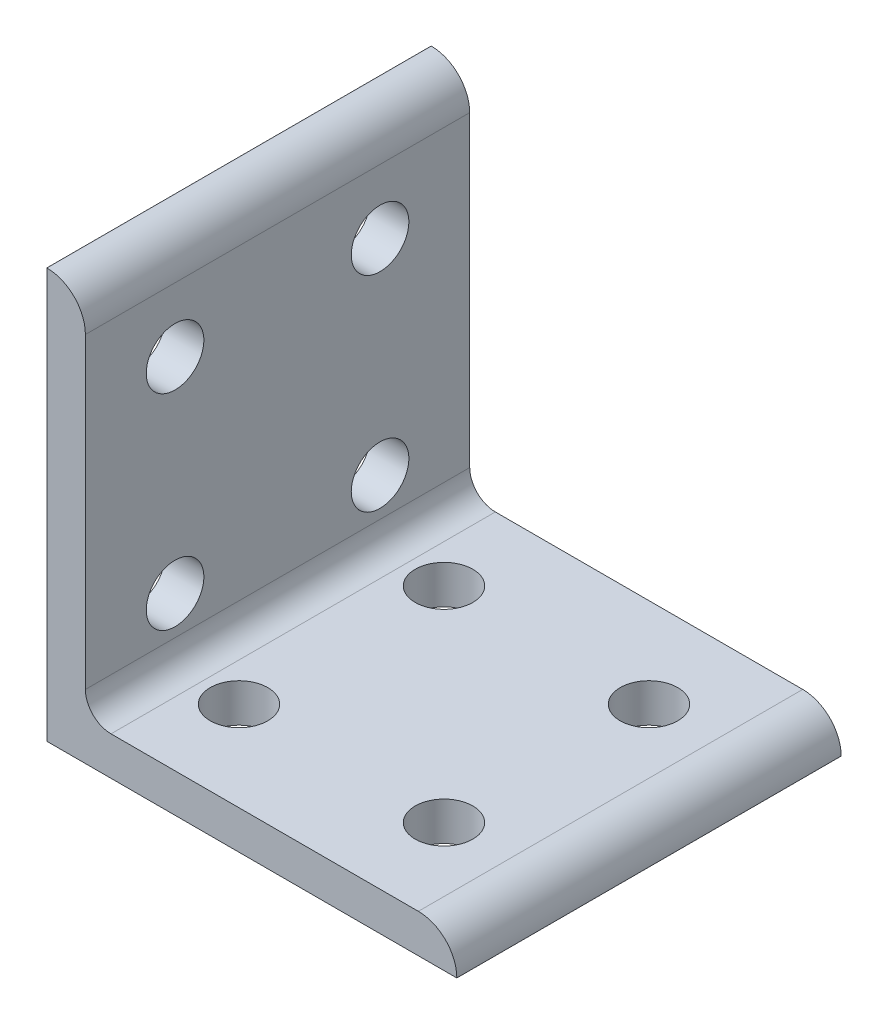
ISO-10303-21;
HEADER;
FILE_DESCRIPTION(('STEP AP214'),'2;1');
FILE_NAME('part.step','',(''),(''),'','','');
FILE_SCHEMA(('AUTOMOTIVE_DESIGN { 1 0 10303 214 1 1 1 1 }'));
ENDSEC;
DATA;
#1=APPLICATION_CONTEXT('core data for automotive mechanical design processes');
#2=APPLICATION_PROTOCOL_DEFINITION('international standard','automotive_design',2000,#1);
#3=PRODUCT_CONTEXT('',#1,'mechanical');
#4=PRODUCT('Part','Part','',(#3));
#5=PRODUCT_RELATED_PRODUCT_CATEGORY('part','',(#4));
#6=PRODUCT_DEFINITION_FORMATION('','',#4);
#7=PRODUCT_DEFINITION_CONTEXT('part definition',#1,'design');
#8=PRODUCT_DEFINITION('design','',#6,#7);
#9=PRODUCT_DEFINITION_SHAPE('','',#8);
#10=(LENGTH_UNIT() NAMED_UNIT(*) SI_UNIT(.MILLI.,.METRE.));
#11=(NAMED_UNIT(*) PLANE_ANGLE_UNIT() SI_UNIT($,.RADIAN.));
#12=(NAMED_UNIT(*) SI_UNIT($,.STERADIAN.) SOLID_ANGLE_UNIT());
#13=UNCERTAINTY_MEASURE_WITH_UNIT(LENGTH_MEASURE(1.E-05),#10,'distance_accuracy_value','');
#14=(GEOMETRIC_REPRESENTATION_CONTEXT(3) GLOBAL_UNCERTAINTY_ASSIGNED_CONTEXT((#13)) GLOBAL_UNIT_ASSIGNED_CONTEXT((#10,
#11,#12)) REPRESENTATION_CONTEXT('',''));
#15=CARTESIAN_POINT('',(0.,0.,0.));
#16=DIRECTION('',(0.,0.,1.));
#17=DIRECTION('',(1.,0.,0.));
#18=AXIS2_PLACEMENT_3D('',#15,#16,#17);
#19=CARTESIAN_POINT('',(46.0374999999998,0.0126999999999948,-23.8125000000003));
#20=DIRECTION('',(0.,0.,1.));
#21=DIRECTION('',(1.,0.,0.));
#22=AXIS2_PLACEMENT_3D('',#19,#20,#21);
#23=CYLINDRICAL_SURFACE('',#22,4.7625);
#24=CARTESIAN_POINT('',(46.0375000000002,0.0126999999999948,23.8124999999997));
#25=DIRECTION('',(0.,0.,1.));
#26=DIRECTION('',(1.,0.,0.));
#27=AXIS2_PLACEMENT_3D('',#24,#25,#26);
#28=CIRCLE('',#27,4.7625);
#29=CARTESIAN_POINT('',(50.8000000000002,0.0126999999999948,23.8124999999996));
#30=VERTEX_POINT('',#29);
#31=CARTESIAN_POINT('',(46.0375,4.7752,23.8124999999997));
#32=VERTEX_POINT('',#31);
#33=EDGE_CURVE('E112',#30,#32,#28,.T.);
#34=ORIENTED_EDGE('',*,*,#33,.F.);
#35=DIRECTION('',(0.,0.,1.));
#36=VECTOR('',#35,1.);
#37=CARTESIAN_POINT('',(50.7999999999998,0.0126999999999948,-23.8125000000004));
#38=LINE('',#37,#36);
#39=CARTESIAN_POINT('',(50.7999999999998,0.0126999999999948,-23.8125000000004));
#40=VERTEX_POINT('',#39);
#41=EDGE_CURVE('E132',#30,#40,#38,.F.);
#42=ORIENTED_EDGE('',*,*,#41,.T.);
#43=CARTESIAN_POINT('',(46.0374999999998,0.0126999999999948,-23.8125000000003));
#44=DIRECTION('',(0.,0.,1.));
#45=DIRECTION('',(1.,0.,0.));
#46=AXIS2_PLACEMENT_3D('',#43,#44,#45);
#47=CIRCLE('',#46,4.7625);
#48=CARTESIAN_POINT('',(46.0374999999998,4.7752,-23.8125000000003));
#49=VERTEX_POINT('',#48);
#50=EDGE_CURVE('E187',#40,#49,#47,.T.);
#51=ORIENTED_EDGE('',*,*,#50,.T.);
#52=DIRECTION('',(0.,0.,-1.));
#53=VECTOR('',#52,1.);
#54=CARTESIAN_POINT('',(46.0374999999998,4.7752,-23.8125000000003));
#55=LINE('',#54,#53);
#56=EDGE_CURVE('E99',#49,#32,#55,.F.);
#57=ORIENTED_EDGE('',*,*,#56,.T.);
#58=EDGE_LOOP('',(#34,#42,#51,#57));
#59=FACE_BOUND('',#58,.T.);
#60=ADVANCED_FACE('F16',(#59),#23,.T.);
#61=CARTESIAN_POINT('',(7.95019999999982,7.95019999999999,-23.8125000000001));
#62=DIRECTION('',(0.,0.,1.));
#63=DIRECTION('',(1.,0.,0.));
#64=AXIS2_PLACEMENT_3D('',#61,#62,#63);
#65=CYLINDRICAL_SURFACE('',#64,3.175);
#66=CARTESIAN_POINT('',(7.95019999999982,7.95019999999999,-23.8125000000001));
#67=DIRECTION('',(0.,0.,1.));
#68=DIRECTION('',(1.,0.,0.));
#69=AXIS2_PLACEMENT_3D('',#66,#67,#68);
#70=CIRCLE('',#69,3.175);
#71=CARTESIAN_POINT('',(7.95019999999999,4.7752,-23.8125000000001));
#72=VERTEX_POINT('',#71);
#73=CARTESIAN_POINT('',(4.77519999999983,7.95019999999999,-23.8125));
#74=VERTEX_POINT('',#73);
#75=EDGE_CURVE('E183',#72,#74,#70,.F.);
#76=ORIENTED_EDGE('',*,*,#75,.T.);
#77=DIRECTION('',(0.,0.,1.));
#78=VECTOR('',#77,1.);
#79=CARTESIAN_POINT('',(4.77519999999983,7.95019999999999,-23.8125));
#80=LINE('',#79,#78);
#81=CARTESIAN_POINT('',(4.77520000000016,7.95019999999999,23.8125));
#82=VERTEX_POINT('',#81);
#83=EDGE_CURVE('E124',#74,#82,#80,.T.);
#84=ORIENTED_EDGE('',*,*,#83,.T.);
#85=CARTESIAN_POINT('',(7.95020000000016,7.95019999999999,23.8124999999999));
#86=DIRECTION('',(0.,0.,1.));
#87=DIRECTION('',(1.,0.,0.));
#88=AXIS2_PLACEMENT_3D('',#85,#86,#87);
#89=CIRCLE('',#88,3.175);
#90=CARTESIAN_POINT('',(7.95020000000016,4.7752,23.8124999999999));
#91=VERTEX_POINT('',#90);
#92=EDGE_CURVE('E190',#91,#82,#89,.F.);
#93=ORIENTED_EDGE('',*,*,#92,.F.);
#94=DIRECTION('',(0.,0.,-1.));
#95=VECTOR('',#94,1.);
#96=CARTESIAN_POINT('',(7.95020000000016,4.7752,-23.8125000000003));
#97=LINE('',#96,#95);
#98=EDGE_CURVE('E129',#91,#72,#97,.T.);
#99=ORIENTED_EDGE('',*,*,#98,.T.);
#100=EDGE_LOOP('',(#76,#84,#93,#99));
#101=FACE_BOUND('',#100,.T.);
#102=ADVANCED_FACE('F281',(#101),#65,.F.);
#103=CARTESIAN_POINT('',(4.77519999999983,7.95019999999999,-23.8125));
#104=DIRECTION('',(-1.,0.,0.));
#105=DIRECTION('',(0.,0.,1.));
#106=AXIS2_PLACEMENT_3D('',#103,#104,#105);
#107=PLANE('',#106);
#108=CARTESIAN_POINT('',(4.77520000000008,38.1,12.7));
#109=DIRECTION('',(-1.,0.,0.));
#110=DIRECTION('',(0.,0.,1.));
#111=AXIS2_PLACEMENT_3D('',#108,#109,#110);
#112=CIRCLE('',#111,3.5687);
#113=CARTESIAN_POINT('',(4.77520000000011,38.1,16.2687));
#114=VERTEX_POINT('',#113);
#115=EDGE_CURVE('E131',#114,#114,#112,.T.);
#116=ORIENTED_EDGE('',*,*,#115,.T.);
#117=EDGE_LOOP('',(#116));
#118=FACE_BOUND('',#117,.T.);
#119=CARTESIAN_POINT('',(4.77520000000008,12.7,12.7));
#120=DIRECTION('',(-1.,0.,0.));
#121=DIRECTION('',(0.,0.,1.));
#122=AXIS2_PLACEMENT_3D('',#119,#120,#121);
#123=CIRCLE('',#122,3.5687);
#124=CARTESIAN_POINT('',(4.77520000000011,12.7,16.2687));
#125=VERTEX_POINT('',#124);
#126=EDGE_CURVE('E194',#125,#125,#123,.T.);
#127=ORIENTED_EDGE('',*,*,#126,.T.);
#128=EDGE_LOOP('',(#127));
#129=FACE_BOUND('',#128,.T.);
#130=CARTESIAN_POINT('',(4.7751999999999,12.7,-12.7));
#131=DIRECTION('',(-1.,0.,0.));
#132=DIRECTION('',(0.,0.,1.));
#133=AXIS2_PLACEMENT_3D('',#130,#131,#132);
#134=CIRCLE('',#133,3.5687);
#135=CARTESIAN_POINT('',(4.77519999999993,12.7,-9.13130000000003));
#136=VERTEX_POINT('',#135);
#137=EDGE_CURVE('E196',#136,#136,#134,.T.);
#138=ORIENTED_EDGE('',*,*,#137,.T.);
#139=EDGE_LOOP('',(#138));
#140=FACE_BOUND('',#139,.T.);
#141=CARTESIAN_POINT('',(4.7751999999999,38.1,-12.7));
#142=DIRECTION('',(-1.,0.,0.));
#143=DIRECTION('',(0.,0.,1.));
#144=AXIS2_PLACEMENT_3D('',#141,#142,#143);
#145=CIRCLE('',#144,3.5687);
#146=CARTESIAN_POINT('',(4.77519999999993,38.1,-9.13130000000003));
#147=VERTEX_POINT('',#146);
#148=EDGE_CURVE('E19',#147,#147,#145,.T.);
#149=ORIENTED_EDGE('',*,*,#148,.T.);
#150=EDGE_LOOP('',(#149));
#151=FACE_BOUND('',#150,.T.);
#152=DIRECTION('',(0.,1.,0.));
#153=VECTOR('',#152,1.);
#154=CARTESIAN_POINT('',(4.77519999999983,0.0126999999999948,-23.8125));
#155=LINE('',#154,#153);
#156=CARTESIAN_POINT('',(4.77519999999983,46.0375,-23.8125));
#157=VERTEX_POINT('',#156);
#158=EDGE_CURVE('E182',#74,#157,#155,.T.);
#159=ORIENTED_EDGE('',*,*,#158,.T.);
#160=DIRECTION('',(0.,0.,1.));
#161=VECTOR('',#160,1.);
#162=CARTESIAN_POINT('',(4.77519999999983,46.0375,-23.8125));
#163=LINE('',#162,#161);
#164=CARTESIAN_POINT('',(4.77520000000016,46.0375,23.8125));
#165=VERTEX_POINT('',#164);
#166=EDGE_CURVE('E85',#165,#157,#163,.F.);
#167=ORIENTED_EDGE('',*,*,#166,.F.);
#168=DIRECTION('',(0.,1.,0.));
#169=VECTOR('',#168,1.);
#170=CARTESIAN_POINT('',(4.77520000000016,0.0126999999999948,23.8125));
#171=LINE('',#170,#169);
#172=EDGE_CURVE('E97',#82,#165,#171,.T.);
#173=ORIENTED_EDGE('',*,*,#172,.F.);
#174=ORIENTED_EDGE('',*,*,#83,.F.);
#175=EDGE_LOOP('',(#159,#167,#173,#174));
#176=FACE_BOUND('',#175,.T.);
#177=ADVANCED_FACE('F203',(#118,#129,#140,#151,#176),#107,.F.);
#178=CARTESIAN_POINT('',(0.0126999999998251,46.0375,-23.8125));
#179=DIRECTION('',(0.,0.,1.));
#180=DIRECTION('',(1.,0.,0.));
#181=AXIS2_PLACEMENT_3D('',#178,#179,#180);
#182=CYLINDRICAL_SURFACE('',#181,4.7625);
#183=CARTESIAN_POINT('',(0.0127000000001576,46.0375,23.8125));
#184=DIRECTION('',(0.,0.,1.));
#185=DIRECTION('',(1.,0.,0.));
#186=AXIS2_PLACEMENT_3D('',#183,#184,#185);
#187=CIRCLE('',#186,4.7625);
#188=CARTESIAN_POINT('',(0.0126999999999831,50.8,23.8125));
#189=VERTEX_POINT('',#188);
#190=EDGE_CURVE('E90',#165,#189,#187,.T.);
#191=ORIENTED_EDGE('',*,*,#190,.F.);
#192=ORIENTED_EDGE('',*,*,#166,.T.);
#193=CARTESIAN_POINT('',(0.0126999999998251,46.0375,-23.8125));
#194=DIRECTION('',(0.,0.,1.));
#195=DIRECTION('',(1.,0.,0.));
#196=AXIS2_PLACEMENT_3D('',#193,#194,#195);
#197=CIRCLE('',#196,4.7625);
#198=CARTESIAN_POINT('',(0.0126999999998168,50.8,-23.8125));
#199=VERTEX_POINT('',#198);
#200=EDGE_CURVE('E105',#157,#199,#197,.T.);
#201=ORIENTED_EDGE('',*,*,#200,.T.);
#202=DIRECTION('',(0.,0.,-1.));
#203=VECTOR('',#202,1.);
#204=CARTESIAN_POINT('',(0.0126999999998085,50.8,-23.8125));
#205=LINE('',#204,#203);
#206=EDGE_CURVE('E102',#199,#189,#205,.F.);
#207=ORIENTED_EDGE('',*,*,#206,.T.);
#208=EDGE_LOOP('',(#191,#192,#201,#207));
#209=FACE_BOUND('',#208,.T.);
#210=ADVANCED_FACE('F103',(#209),#182,.T.);
#211=CARTESIAN_POINT('',(-1.68921778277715E-13,50.8,-23.8125));
#212=DIRECTION('',(0.,-1.,0.));
#213=DIRECTION('',(0.,0.,-1.));
#214=AXIS2_PLACEMENT_3D('',#211,#212,#213);
#215=PLANE('',#214);
#216=DIRECTION('',(1.,0.,0.));
#217=VECTOR('',#216,1.);
#218=CARTESIAN_POINT('',(46.0374999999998,50.8,-23.8125000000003));
#219=LINE('',#218,#217);
#220=CARTESIAN_POINT('',(-1.66533453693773E-13,50.8,-23.8125));
#221=VERTEX_POINT('',#220);
#222=EDGE_CURVE('E149',#199,#221,#219,.F.);
#223=ORIENTED_EDGE('',*,*,#222,.T.);
#224=DIRECTION('',(0.,0.,-1.));
#225=VECTOR('',#224,1.);
#226=CARTESIAN_POINT('',(-1.68921778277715E-13,50.8,-23.8125));
#227=LINE('',#226,#225);
#228=CARTESIAN_POINT('',(1.65087636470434E-13,50.8,23.8125));
#229=VERTEX_POINT('',#228);
#230=EDGE_CURVE('E111',#221,#229,#227,.F.);
#231=ORIENTED_EDGE('',*,*,#230,.T.);
#232=DIRECTION('',(1.,0.,0.));
#233=VECTOR('',#232,1.);
#234=CARTESIAN_POINT('',(46.0375000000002,50.8,23.8124999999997));
#235=LINE('',#234,#233);
#236=EDGE_CURVE('E95',#189,#229,#235,.F.);
#237=ORIENTED_EDGE('',*,*,#236,.F.);
#238=ORIENTED_EDGE('',*,*,#206,.F.);
#239=EDGE_LOOP('',(#223,#231,#237,#238));
#240=FACE_BOUND('',#239,.T.);
#241=ADVANCED_FACE('F110',(#240),#215,.F.);
#242=CARTESIAN_POINT('',(50.8009999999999,38.1,-12.7000000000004));
#243=DIRECTION('',(-1.,0.,0.));
#244=DIRECTION('',(0.,0.,1.));
#245=AXIS2_PLACEMENT_3D('',#242,#243,#244);
#246=CYLINDRICAL_SURFACE('',#245,3.5687);
#247=ORIENTED_EDGE('',*,*,#148,.F.);
#248=EDGE_LOOP('',(#247));
#249=FACE_BOUND('',#248,.T.);
#250=CARTESIAN_POINT('',(0.,38.1,-12.7));
#251=DIRECTION('',(-1.,0.,0.));
#252=DIRECTION('',(0.,0.,1.));
#253=AXIS2_PLACEMENT_3D('',#250,#251,#252);
#254=CIRCLE('',#253,3.5687);
#255=CARTESIAN_POINT('',(0.,38.1,-9.1313));
#256=VERTEX_POINT('',#255);
#257=EDGE_CURVE('E120',#256,#256,#254,.T.);
#258=ORIENTED_EDGE('',*,*,#257,.T.);
#259=EDGE_LOOP('',(#258));
#260=FACE_BOUND('',#259,.T.);
#261=ADVANCED_FACE('F205',(#249,#260),#246,.F.);
#262=CARTESIAN_POINT('',(50.8009999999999,12.7,-12.7000000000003));
#263=DIRECTION('',(-1.,0.,0.));
#264=DIRECTION('',(0.,0.,1.));
#265=AXIS2_PLACEMENT_3D('',#262,#263,#264);
#266=CYLINDRICAL_SURFACE('',#265,3.5687);
#267=ORIENTED_EDGE('',*,*,#137,.F.);
#268=EDGE_LOOP('',(#267));
#269=FACE_BOUND('',#268,.T.);
#270=CARTESIAN_POINT('',(0.,12.7,-12.7));
#271=DIRECTION('',(-1.,0.,0.));
#272=DIRECTION('',(0.,0.,1.));
#273=AXIS2_PLACEMENT_3D('',#270,#271,#272);
#274=CIRCLE('',#273,3.5687);
#275=CARTESIAN_POINT('',(0.,12.7,-9.13129999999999));
#276=VERTEX_POINT('',#275);
#277=EDGE_CURVE('E176',#276,#276,#274,.T.);
#278=ORIENTED_EDGE('',*,*,#277,.T.);
#279=EDGE_LOOP('',(#278));
#280=FACE_BOUND('',#279,.T.);
#281=ADVANCED_FACE('F208',(#269,#280),#266,.F.);
#282=CARTESIAN_POINT('',(50.8010000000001,12.7,12.6999999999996));
#283=DIRECTION('',(-1.,0.,0.));
#284=DIRECTION('',(0.,0.,1.));
#285=AXIS2_PLACEMENT_3D('',#282,#283,#284);
#286=CYLINDRICAL_SURFACE('',#285,3.5687);
#287=ORIENTED_EDGE('',*,*,#126,.F.);
#288=EDGE_LOOP('',(#287));
#289=FACE_BOUND('',#288,.T.);
#290=CARTESIAN_POINT('',(0.,12.7,12.7));
#291=DIRECTION('',(-1.,0.,0.));
#292=DIRECTION('',(0.,0.,1.));
#293=AXIS2_PLACEMENT_3D('',#290,#291,#292);
#294=CIRCLE('',#293,3.5687);
#295=CARTESIAN_POINT('',(1.15125719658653E-13,12.7,16.2687));
#296=VERTEX_POINT('',#295);
#297=EDGE_CURVE('E173',#296,#296,#294,.T.);
#298=ORIENTED_EDGE('',*,*,#297,.T.);
#299=EDGE_LOOP('',(#298));
#300=FACE_BOUND('',#299,.T.);
#301=ADVANCED_FACE('F296',(#289,#300),#286,.F.);
#302=CARTESIAN_POINT('',(50.8010000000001,38.1,12.6999999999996));
#303=DIRECTION('',(-1.,0.,0.));
#304=DIRECTION('',(0.,0.,1.));
#305=AXIS2_PLACEMENT_3D('',#302,#303,#304);
#306=CYLINDRICAL_SURFACE('',#305,3.5687);
#307=ORIENTED_EDGE('',*,*,#115,.F.);
#308=EDGE_LOOP('',(#307));
#309=FACE_BOUND('',#308,.T.);
#310=CARTESIAN_POINT('',(0.,38.1,12.7));
#311=DIRECTION('',(-1.,0.,0.));
#312=DIRECTION('',(0.,0.,1.));
#313=AXIS2_PLACEMENT_3D('',#310,#311,#312);
#314=CIRCLE('',#313,3.5687);
#315=CARTESIAN_POINT('',(1.15125719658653E-13,38.1,16.2687));
#316=VERTEX_POINT('',#315);
#317=EDGE_CURVE('E170',#316,#316,#314,.T.);
#318=ORIENTED_EDGE('',*,*,#317,.T.);
#319=EDGE_LOOP('',(#318));
#320=FACE_BOUND('',#319,.T.);
#321=ADVANCED_FACE('F300',(#309,#320),#306,.F.);
#322=CARTESIAN_POINT('',(46.0374999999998,4.7752,-23.8125000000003));
#323=DIRECTION('',(0.,-1.,0.));
#324=DIRECTION('',(0.,0.,-1.));
#325=AXIS2_PLACEMENT_3D('',#322,#323,#324);
#326=PLANE('',#325);
#327=CARTESIAN_POINT('',(38.0999999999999,4.77519999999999,-12.7000000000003));
#328=DIRECTION('',(0.,-1.,0.));
#329=DIRECTION('',(1.,0.,0.));
#330=AXIS2_PLACEMENT_3D('',#327,#328,#329);
#331=CIRCLE('',#330,3.5687);
#332=CARTESIAN_POINT('',(41.6686999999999,4.77519999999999,-12.7000000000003));
#333=VERTEX_POINT('',#332);
#334=EDGE_CURVE('E148',#333,#333,#331,.T.);
#335=ORIENTED_EDGE('',*,*,#334,.T.);
#336=EDGE_LOOP('',(#335));
#337=FACE_BOUND('',#336,.T.);
#338=CARTESIAN_POINT('',(12.6999999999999,4.77519999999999,-12.7000000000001));
#339=DIRECTION('',(0.,-1.,0.));
#340=DIRECTION('',(1.,0.,0.));
#341=AXIS2_PLACEMENT_3D('',#338,#339,#340);
#342=CIRCLE('',#341,3.5687);
#343=CARTESIAN_POINT('',(16.2686999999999,4.77519999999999,-12.7000000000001));
#344=VERTEX_POINT('',#343);
#345=EDGE_CURVE('E161',#344,#344,#342,.T.);
#346=ORIENTED_EDGE('',*,*,#345,.T.);
#347=EDGE_LOOP('',(#346));
#348=FACE_BOUND('',#347,.T.);
#349=CARTESIAN_POINT('',(12.7000000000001,4.77519999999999,12.6999999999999));
#350=DIRECTION('',(0.,-1.,0.));
#351=DIRECTION('',(1.,0.,0.));
#352=AXIS2_PLACEMENT_3D('',#349,#350,#351);
#353=CIRCLE('',#352,3.5687);
#354=CARTESIAN_POINT('',(16.2687000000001,4.77519999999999,12.6999999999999));
#355=VERTEX_POINT('',#354);
#356=EDGE_CURVE('E164',#355,#355,#353,.T.);
#357=ORIENTED_EDGE('',*,*,#356,.T.);
#358=EDGE_LOOP('',(#357));
#359=FACE_BOUND('',#358,.T.);
#360=CARTESIAN_POINT('',(38.1000000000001,4.77519999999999,12.6999999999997));
#361=DIRECTION('',(0.,-1.,0.));
#362=DIRECTION('',(1.,0.,0.));
#363=AXIS2_PLACEMENT_3D('',#360,#361,#362);
#364=CIRCLE('',#363,3.5687);
#365=CARTESIAN_POINT('',(41.6687000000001,4.77519999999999,12.6999999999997));
#366=VERTEX_POINT('',#365);
#367=EDGE_CURVE('E167',#366,#366,#364,.T.);
#368=ORIENTED_EDGE('',*,*,#367,.T.);
#369=EDGE_LOOP('',(#368));
#370=FACE_BOUND('',#369,.T.);
#371=DIRECTION('',(1.,0.,0.));
#372=VECTOR('',#371,1.);
#373=CARTESIAN_POINT('',(46.0374999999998,4.7752,-23.8125000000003));
#374=LINE('',#373,#372);
#375=EDGE_CURVE('E186',#49,#72,#374,.F.);
#376=ORIENTED_EDGE('',*,*,#375,.T.);
#377=ORIENTED_EDGE('',*,*,#98,.F.);
#378=DIRECTION('',(1.,0.,0.));
#379=VECTOR('',#378,1.);
#380=CARTESIAN_POINT('',(46.0375000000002,4.7752,23.8124999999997));
#381=LINE('',#380,#379);
#382=EDGE_CURVE('E114',#32,#91,#381,.F.);
#383=ORIENTED_EDGE('',*,*,#382,.F.);
#384=ORIENTED_EDGE('',*,*,#56,.F.);
#385=EDGE_LOOP('',(#376,#377,#383,#384));
#386=FACE_BOUND('',#385,.T.);
#387=ADVANCED_FACE('F273',(#337,#348,#359,#370,#386),#326,.F.);
#388=CARTESIAN_POINT('',(46.0375000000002,0.0126999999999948,23.8124999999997));
#389=DIRECTION('',(0.,0.,1.));
#390=DIRECTION('',(1.,0.,0.));
#391=AXIS2_PLACEMENT_3D('',#388,#389,#390);
#392=PLANE('',#391);
#393=ORIENTED_EDGE('',*,*,#92,.T.);
#394=ORIENTED_EDGE('',*,*,#172,.T.);
#395=ORIENTED_EDGE('',*,*,#190,.T.);
#396=ORIENTED_EDGE('',*,*,#236,.T.);
#397=DIRECTION('',(0.,1.,0.));
#398=VECTOR('',#397,1.);
#399=CARTESIAN_POINT('',(1.63641819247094E-13,50.8,23.8125));
#400=LINE('',#399,#398);
#401=CARTESIAN_POINT('',(0.,0.,23.8125));
#402=VERTEX_POINT('',#401);
#403=EDGE_CURVE('E122',#229,#402,#400,.F.);
#404=ORIENTED_EDGE('',*,*,#403,.T.);
#405=DIRECTION('',(-1.,0.,0.));
#406=VECTOR('',#405,1.);
#407=CARTESIAN_POINT('',(-1.66281798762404E-13,0.,23.8125));
#408=LINE('',#407,#406);
#409=CARTESIAN_POINT('',(50.8000000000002,0.,23.8124999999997));
#410=VERTEX_POINT('',#409);
#411=EDGE_CURVE('E143',#402,#410,#408,.F.);
#412=ORIENTED_EDGE('',*,*,#411,.T.);
#413=DIRECTION('',(0.,1.,0.));
#414=VECTOR('',#413,1.);
#415=CARTESIAN_POINT('',(50.8000000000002,0.,23.8124999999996));
#416=LINE('',#415,#414);
#417=EDGE_CURVE('E135',#410,#30,#416,.T.);
#418=ORIENTED_EDGE('',*,*,#417,.T.);
#419=ORIENTED_EDGE('',*,*,#33,.T.);
#420=ORIENTED_EDGE('',*,*,#382,.T.);
#421=EDGE_LOOP('',(#393,#394,#395,#396,#404,#412,#418,#419,#420));
#422=FACE_BOUND('',#421,.T.);
#423=ADVANCED_FACE('F92',(#422),#392,.T.);
#424=CARTESIAN_POINT('',(50.7999999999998,0.,-23.8125000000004));
#425=DIRECTION('',(-1.,0.,0.));
#426=DIRECTION('',(0.,0.,1.));
#427=AXIS2_PLACEMENT_3D('',#424,#425,#426);
#428=PLANE('',#427);
#429=DIRECTION('',(0.,1.,0.));
#430=VECTOR('',#429,1.);
#431=CARTESIAN_POINT('',(50.7999999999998,0.0126999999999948,-23.8125000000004));
#432=LINE('',#431,#430);
#433=CARTESIAN_POINT('',(50.7999999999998,0.,-23.8125000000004));
#434=VERTEX_POINT('',#433);
#435=EDGE_CURVE('E134',#434,#40,#432,.T.);
#436=ORIENTED_EDGE('',*,*,#435,.T.);
#437=ORIENTED_EDGE('',*,*,#41,.F.);
#438=ORIENTED_EDGE('',*,*,#417,.F.);
#439=DIRECTION('',(0.,0.,1.));
#440=VECTOR('',#439,1.);
#441=CARTESIAN_POINT('',(50.8000000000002,0.,-23.8125));
#442=LINE('',#441,#440);
#443=EDGE_CURVE('E140',#410,#434,#442,.F.);
#444=ORIENTED_EDGE('',*,*,#443,.T.);
#445=EDGE_LOOP('',(#436,#437,#438,#444));
#446=FACE_BOUND('',#445,.T.);
#447=ADVANCED_FACE('F226',(#446),#428,.F.);
#448=CARTESIAN_POINT('',(46.0374999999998,0.0126999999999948,-23.8125000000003));
#449=DIRECTION('',(0.,0.,1.));
#450=DIRECTION('',(1.,0.,0.));
#451=AXIS2_PLACEMENT_3D('',#448,#449,#450);
#452=PLANE('',#451);
#453=ORIENTED_EDGE('',*,*,#200,.F.);
#454=ORIENTED_EDGE('',*,*,#158,.F.);
#455=ORIENTED_EDGE('',*,*,#75,.F.);
#456=ORIENTED_EDGE('',*,*,#375,.F.);
#457=ORIENTED_EDGE('',*,*,#50,.F.);
#458=ORIENTED_EDGE('',*,*,#435,.F.);
#459=DIRECTION('',(-1.,0.,0.));
#460=VECTOR('',#459,1.);
#461=CARTESIAN_POINT('',(-1.66281798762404E-13,0.,-23.8125000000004));
#462=LINE('',#461,#460);
#463=CARTESIAN_POINT('',(-1.66407626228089E-13,0.,-23.8125000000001));
#464=VERTEX_POINT('',#463);
#465=EDGE_CURVE('E136',#434,#464,#462,.T.);
#466=ORIENTED_EDGE('',*,*,#465,.T.);
#467=DIRECTION('',(0.,1.,0.));
#468=VECTOR('',#467,1.);
#469=CARTESIAN_POINT('',(-1.68921778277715E-13,50.8,-23.8125));
#470=LINE('',#469,#468);
#471=EDGE_CURVE('E34',#464,#221,#470,.T.);
#472=ORIENTED_EDGE('',*,*,#471,.T.);
#473=ORIENTED_EDGE('',*,*,#222,.F.);
#474=EDGE_LOOP('',(#453,#454,#455,#456,#457,#458,#466,#472,#473));
#475=FACE_BOUND('',#474,.T.);
#476=ADVANCED_FACE('F215',(#475),#452,.F.);
#477=CARTESIAN_POINT('',(-1.68921778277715E-13,50.8,-23.8125));
#478=DIRECTION('',(1.,0.,0.));
#479=DIRECTION('',(0.,0.,-1.));
#480=AXIS2_PLACEMENT_3D('',#477,#478,#479);
#481=PLANE('',#480);
#482=ORIENTED_EDGE('',*,*,#317,.F.);
#483=EDGE_LOOP('',(#482));
#484=FACE_BOUND('',#483,.T.);
#485=ORIENTED_EDGE('',*,*,#297,.F.);
#486=EDGE_LOOP('',(#485));
#487=FACE_BOUND('',#486,.T.);
#488=ORIENTED_EDGE('',*,*,#277,.F.);
#489=EDGE_LOOP('',(#488));
#490=FACE_BOUND('',#489,.T.);
#491=ORIENTED_EDGE('',*,*,#257,.F.);
#492=EDGE_LOOP('',(#491));
#493=FACE_BOUND('',#492,.T.);
#494=ORIENTED_EDGE('',*,*,#471,.F.);
#495=DIRECTION('',(0.,0.,1.));
#496=VECTOR('',#495,1.);
#497=CARTESIAN_POINT('',(-1.66281798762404E-13,0.,-23.8125));
#498=LINE('',#497,#496);
#499=EDGE_CURVE('E139',#464,#402,#498,.T.);
#500=ORIENTED_EDGE('',*,*,#499,.T.);
#501=ORIENTED_EDGE('',*,*,#403,.F.);
#502=ORIENTED_EDGE('',*,*,#230,.F.);
#503=EDGE_LOOP('',(#494,#500,#501,#502));
#504=FACE_BOUND('',#503,.T.);
#505=ADVANCED_FACE('F212',(#484,#487,#490,#493,#504),#481,.F.);
#506=CARTESIAN_POINT('',(38.1000000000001,50.8,12.6999999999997));
#507=DIRECTION('',(0.,-1.,0.));
#508=DIRECTION('',(1.,0.,0.));
#509=AXIS2_PLACEMENT_3D('',#506,#507,#508);
#510=CYLINDRICAL_SURFACE('',#509,3.5687);
#511=ORIENTED_EDGE('',*,*,#367,.F.);
#512=EDGE_LOOP('',(#511));
#513=FACE_BOUND('',#512,.T.);
#514=CARTESIAN_POINT('',(38.1000000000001,0.,12.6999999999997));
#515=DIRECTION('',(0.,-1.,0.));
#516=DIRECTION('',(1.,0.,0.));
#517=AXIS2_PLACEMENT_3D('',#514,#515,#516);
#518=CIRCLE('',#517,3.5687);
#519=CARTESIAN_POINT('',(41.6687000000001,0.,12.6999999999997));
#520=VERTEX_POINT('',#519);
#521=EDGE_CURVE('E156',#520,#520,#518,.T.);
#522=ORIENTED_EDGE('',*,*,#521,.T.);
#523=EDGE_LOOP('',(#522));
#524=FACE_BOUND('',#523,.T.);
#525=ADVANCED_FACE('F214',(#513,#524),#510,.F.);
#526=CARTESIAN_POINT('',(12.7000000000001,50.8,12.6999999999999));
#527=DIRECTION('',(0.,-1.,0.));
#528=DIRECTION('',(1.,0.,0.));
#529=AXIS2_PLACEMENT_3D('',#526,#527,#528);
#530=CYLINDRICAL_SURFACE('',#529,3.5687);
#531=ORIENTED_EDGE('',*,*,#356,.F.);
#532=EDGE_LOOP('',(#531));
#533=FACE_BOUND('',#532,.T.);
#534=CARTESIAN_POINT('',(12.7000000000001,0.,12.6999999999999));
#535=DIRECTION('',(0.,-1.,0.));
#536=DIRECTION('',(1.,0.,0.));
#537=AXIS2_PLACEMENT_3D('',#534,#535,#536);
#538=CIRCLE('',#537,3.5687);
#539=CARTESIAN_POINT('',(16.2687000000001,0.,12.6999999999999));
#540=VERTEX_POINT('',#539);
#541=EDGE_CURVE('E153',#540,#540,#538,.T.);
#542=ORIENTED_EDGE('',*,*,#541,.T.);
#543=EDGE_LOOP('',(#542));
#544=FACE_BOUND('',#543,.T.);
#545=ADVANCED_FACE('F223',(#533,#544),#530,.F.);
#546=CARTESIAN_POINT('',(12.6999999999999,50.8,-12.7000000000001));
#547=DIRECTION('',(0.,-1.,0.));
#548=DIRECTION('',(1.,0.,0.));
#549=AXIS2_PLACEMENT_3D('',#546,#547,#548);
#550=CYLINDRICAL_SURFACE('',#549,3.5687);
#551=ORIENTED_EDGE('',*,*,#345,.F.);
#552=EDGE_LOOP('',(#551));
#553=FACE_BOUND('',#552,.T.);
#554=CARTESIAN_POINT('',(12.6999999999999,0.,-12.7000000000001));
#555=DIRECTION('',(0.,-1.,0.));
#556=DIRECTION('',(1.,0.,0.));
#557=AXIS2_PLACEMENT_3D('',#554,#555,#556);
#558=CIRCLE('',#557,3.5687);
#559=CARTESIAN_POINT('',(16.2686999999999,0.,-12.7000000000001));
#560=VERTEX_POINT('',#559);
#561=EDGE_CURVE('E25',#560,#560,#558,.T.);
#562=ORIENTED_EDGE('',*,*,#561,.T.);
#563=EDGE_LOOP('',(#562));
#564=FACE_BOUND('',#563,.T.);
#565=ADVANCED_FACE('F239',(#553,#564),#550,.F.);
#566=CARTESIAN_POINT('',(38.0999999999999,50.8,-12.7000000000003));
#567=DIRECTION('',(0.,-1.,0.));
#568=DIRECTION('',(1.,0.,0.));
#569=AXIS2_PLACEMENT_3D('',#566,#567,#568);
#570=CYLINDRICAL_SURFACE('',#569,3.5687);
#571=ORIENTED_EDGE('',*,*,#334,.F.);
#572=EDGE_LOOP('',(#571));
#573=FACE_BOUND('',#572,.T.);
#574=CARTESIAN_POINT('',(38.0999999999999,0.,-12.7000000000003));
#575=DIRECTION('',(0.,-1.,0.));
#576=DIRECTION('',(1.,0.,0.));
#577=AXIS2_PLACEMENT_3D('',#574,#575,#576);
#578=CIRCLE('',#577,3.5687);
#579=CARTESIAN_POINT('',(41.6686999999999,0.,-12.7000000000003));
#580=VERTEX_POINT('',#579);
#581=EDGE_CURVE('E11',#580,#580,#578,.T.);
#582=ORIENTED_EDGE('',*,*,#581,.T.);
#583=EDGE_LOOP('',(#582));
#584=FACE_BOUND('',#583,.T.);
#585=ADVANCED_FACE('F233',(#573,#584),#570,.F.);
#586=CARTESIAN_POINT('',(-1.66281798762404E-13,0.,-23.8125));
#587=DIRECTION('',(0.,1.,0.));
#588=DIRECTION('',(-1.,0.,0.));
#589=AXIS2_PLACEMENT_3D('',#586,#587,#588);
#590=PLANE('',#589);
#591=ORIENTED_EDGE('',*,*,#581,.F.);
#592=EDGE_LOOP('',(#591));
#593=FACE_BOUND('',#592,.T.);
#594=ORIENTED_EDGE('',*,*,#561,.F.);
#595=EDGE_LOOP('',(#594));
#596=FACE_BOUND('',#595,.T.);
#597=ORIENTED_EDGE('',*,*,#541,.F.);
#598=EDGE_LOOP('',(#597));
#599=FACE_BOUND('',#598,.T.);
#600=ORIENTED_EDGE('',*,*,#521,.F.);
#601=EDGE_LOOP('',(#600));
#602=FACE_BOUND('',#601,.T.);
#603=ORIENTED_EDGE('',*,*,#465,.F.);
#604=ORIENTED_EDGE('',*,*,#443,.F.);
#605=ORIENTED_EDGE('',*,*,#411,.F.);
#606=ORIENTED_EDGE('',*,*,#499,.F.);
#607=EDGE_LOOP('',(#603,#604,#605,#606));
#608=FACE_BOUND('',#607,.T.);
#609=ADVANCED_FACE('F231',(#593,#596,#599,#602,#608),#590,.F.);
#610=CLOSED_SHELL('',(#60,#102,#177,#210,#241,#261,#281,#301,#321,#387,#423,#447,#476,#505,#525,
#545,#565,#585,#609));
#611=MANIFOLD_SOLID_BREP('B1',#610);
#612=ADVANCED_BREP_SHAPE_REPRESENTATION('',(#18,#611),#14);
#613=SHAPE_DEFINITION_REPRESENTATION(#9,#612);
ENDSEC;
END-ISO-10303-21;
